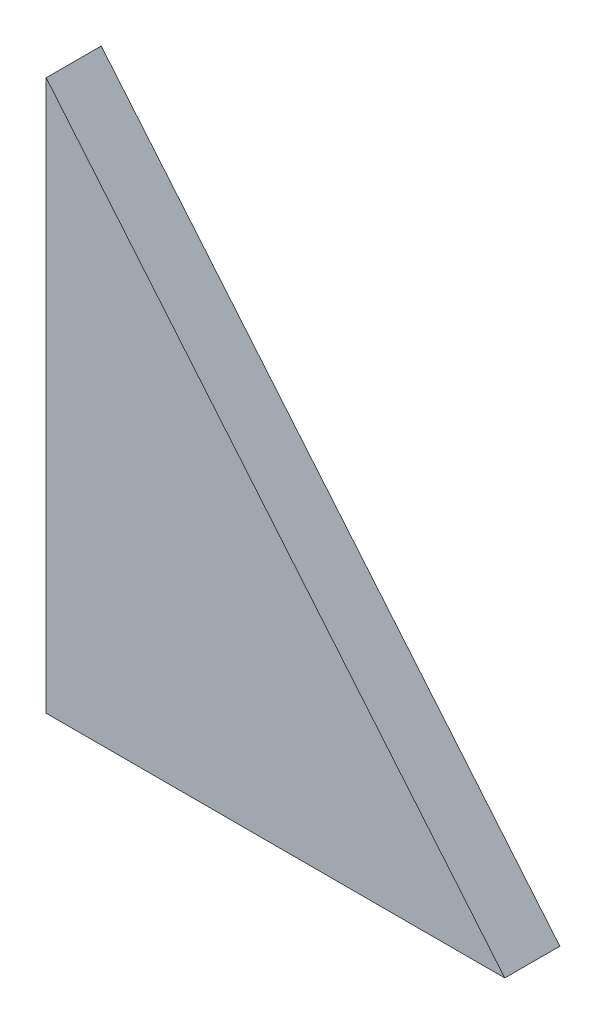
ISO-10303-21;
HEADER;
FILE_DESCRIPTION(('STEP AP214'),'2;1');
FILE_NAME('part.step','',(''),(''),'','','');
FILE_SCHEMA(('AUTOMOTIVE_DESIGN { 1 0 10303 214 1 1 1 1 }'));
ENDSEC;
DATA;
#1=APPLICATION_CONTEXT('core data for automotive mechanical design processes');
#2=APPLICATION_PROTOCOL_DEFINITION('international standard','automotive_design',2000,#1);
#3=PRODUCT_CONTEXT('',#1,'mechanical');
#4=PRODUCT('Part','Part','',(#3));
#5=PRODUCT_RELATED_PRODUCT_CATEGORY('part','',(#4));
#6=PRODUCT_DEFINITION_FORMATION('','',#4);
#7=PRODUCT_DEFINITION_CONTEXT('part definition',#1,'design');
#8=PRODUCT_DEFINITION('design','',#6,#7);
#9=PRODUCT_DEFINITION_SHAPE('','',#8);
#10=(LENGTH_UNIT() NAMED_UNIT(*) SI_UNIT(.MILLI.,.METRE.));
#11=(NAMED_UNIT(*) PLANE_ANGLE_UNIT() SI_UNIT($,.RADIAN.));
#12=(NAMED_UNIT(*) SI_UNIT($,.STERADIAN.) SOLID_ANGLE_UNIT());
#13=UNCERTAINTY_MEASURE_WITH_UNIT(LENGTH_MEASURE(1.E-05),#10,'distance_accuracy_value','');
#14=(GEOMETRIC_REPRESENTATION_CONTEXT(3) GLOBAL_UNCERTAINTY_ASSIGNED_CONTEXT((#13)) GLOBAL_UNIT_ASSIGNED_CONTEXT((#10,
#11,#12)) REPRESENTATION_CONTEXT('',''));
#15=CARTESIAN_POINT('',(0.,0.,0.));
#16=DIRECTION('',(0.,0.,1.));
#17=DIRECTION('',(1.,0.,0.));
#18=AXIS2_PLACEMENT_3D('',#15,#16,#17);
#19=CARTESIAN_POINT('',(50.,0.,6.));
#20=DIRECTION('',(-0.768221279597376,-0.64018439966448,0.));
#21=DIRECTION('',(0.64018439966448,-0.768221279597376,0.));
#22=AXIS2_PLACEMENT_3D('',#19,#20,#21);
#23=PLANE('',#22);
#24=DIRECTION('',(-0.64018439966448,0.768221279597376,0.));
#25=VECTOR('',#24,1.);
#26=CARTESIAN_POINT('',(50.,0.,0.));
#27=LINE('',#26,#25);
#28=CARTESIAN_POINT('',(50.,0.,0.));
#29=VERTEX_POINT('',#28);
#30=CARTESIAN_POINT('',(0.,60.,0.));
#31=VERTEX_POINT('',#30);
#32=EDGE_CURVE('E65',#29,#31,#27,.T.);
#33=ORIENTED_EDGE('',*,*,#32,.T.);
#34=DIRECTION('',(0.,0.,-1.));
#35=VECTOR('',#34,1.);
#36=CARTESIAN_POINT('',(0.,60.,6.));
#37=LINE('',#36,#35);
#38=CARTESIAN_POINT('',(0.,60.,6.));
#39=VERTEX_POINT('',#38);
#40=EDGE_CURVE('E11',#39,#31,#37,.T.);
#41=ORIENTED_EDGE('',*,*,#40,.F.);
#42=DIRECTION('',(-0.64018439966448,0.768221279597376,0.));
#43=VECTOR('',#42,1.);
#44=CARTESIAN_POINT('',(50.,0.,6.));
#45=LINE('',#44,#43);
#46=CARTESIAN_POINT('',(50.,0.,6.));
#47=VERTEX_POINT('',#46);
#48=EDGE_CURVE('E79',#47,#39,#45,.T.);
#49=ORIENTED_EDGE('',*,*,#48,.F.);
#50=DIRECTION('',(0.,0.,-1.));
#51=VECTOR('',#50,1.);
#52=CARTESIAN_POINT('',(50.,0.,6.));
#53=LINE('',#52,#51);
#54=EDGE_CURVE('E75',#47,#29,#53,.T.);
#55=ORIENTED_EDGE('',*,*,#54,.T.);
#56=EDGE_LOOP('',(#33,#41,#49,#55));
#57=FACE_BOUND('',#56,.T.);
#58=ADVANCED_FACE('F29',(#57),#23,.F.);
#59=CARTESIAN_POINT('',(0.,60.,6.));
#60=DIRECTION('',(1.,0.,0.));
#61=DIRECTION('',(0.,1.,0.));
#62=AXIS2_PLACEMENT_3D('',#59,#60,#61);
#63=PLANE('',#62);
#64=DIRECTION('',(0.,-1.,0.));
#65=VECTOR('',#64,1.);
#66=CARTESIAN_POINT('',(0.,60.,0.));
#67=LINE('',#66,#65);
#68=CARTESIAN_POINT('',(0.,0.,0.));
#69=VERTEX_POINT('',#68);
#70=EDGE_CURVE('E62',#31,#69,#67,.T.);
#71=ORIENTED_EDGE('',*,*,#70,.T.);
#72=DIRECTION('',(0.,0.,-1.));
#73=VECTOR('',#72,1.);
#74=CARTESIAN_POINT('',(0.,0.,6.));
#75=LINE('',#74,#73);
#76=CARTESIAN_POINT('',(0.,0.,6.));
#77=VERTEX_POINT('',#76);
#78=EDGE_CURVE('E36',#77,#69,#75,.T.);
#79=ORIENTED_EDGE('',*,*,#78,.F.);
#80=DIRECTION('',(0.,-1.,0.));
#81=VECTOR('',#80,1.);
#82=CARTESIAN_POINT('',(0.,60.,6.));
#83=LINE('',#82,#81);
#84=EDGE_CURVE('E47',#39,#77,#83,.T.);
#85=ORIENTED_EDGE('',*,*,#84,.F.);
#86=ORIENTED_EDGE('',*,*,#40,.T.);
#87=EDGE_LOOP('',(#71,#79,#85,#86));
#88=FACE_BOUND('',#87,.T.);
#89=ADVANCED_FACE('F71',(#88),#63,.F.);
#90=CARTESIAN_POINT('',(0.,0.,6.));
#91=DIRECTION('',(0.,1.,0.));
#92=DIRECTION('',(0.,0.,1.));
#93=AXIS2_PLACEMENT_3D('',#90,#91,#92);
#94=PLANE('',#93);
#95=DIRECTION('',(1.,0.,0.));
#96=VECTOR('',#95,1.);
#97=CARTESIAN_POINT('',(0.,0.,0.));
#98=LINE('',#97,#96);
#99=EDGE_CURVE('E66',#69,#29,#98,.T.);
#100=ORIENTED_EDGE('',*,*,#99,.T.);
#101=ORIENTED_EDGE('',*,*,#54,.F.);
#102=DIRECTION('',(1.,0.,0.));
#103=VECTOR('',#102,1.);
#104=CARTESIAN_POINT('',(0.,0.,6.));
#105=LINE('',#104,#103);
#106=EDGE_CURVE('E43',#77,#47,#105,.T.);
#107=ORIENTED_EDGE('',*,*,#106,.F.);
#108=ORIENTED_EDGE('',*,*,#78,.T.);
#109=EDGE_LOOP('',(#100,#101,#107,#108));
#110=FACE_BOUND('',#109,.T.);
#111=ADVANCED_FACE('F84',(#110),#94,.F.);
#112=CARTESIAN_POINT('',(50.,0.,6.));
#113=DIRECTION('',(0.,0.,-1.));
#114=DIRECTION('',(-1.,0.,0.));
#115=AXIS2_PLACEMENT_3D('',#112,#113,#114);
#116=PLANE('',#115);
#117=ORIENTED_EDGE('',*,*,#48,.T.);
#118=ORIENTED_EDGE('',*,*,#84,.T.);
#119=ORIENTED_EDGE('',*,*,#106,.T.);
#120=EDGE_LOOP('',(#117,#118,#119));
#121=FACE_BOUND('',#120,.T.);
#122=ADVANCED_FACE('F85',(#121),#116,.F.);
#123=CARTESIAN_POINT('',(50.,0.,0.));
#124=DIRECTION('',(0.,0.,-1.));
#125=DIRECTION('',(-1.,0.,0.));
#126=AXIS2_PLACEMENT_3D('',#123,#124,#125);
#127=PLANE('',#126);
#128=ORIENTED_EDGE('',*,*,#32,.F.);
#129=ORIENTED_EDGE('',*,*,#99,.F.);
#130=ORIENTED_EDGE('',*,*,#70,.F.);
#131=EDGE_LOOP('',(#128,#129,#130));
#132=FACE_BOUND('',#131,.T.);
#133=ADVANCED_FACE('F63',(#132),#127,.T.);
#134=CLOSED_SHELL('',(#58,#89,#111,#122,#133));
#135=MANIFOLD_SOLID_BREP('B2',#134);
#136=ADVANCED_BREP_SHAPE_REPRESENTATION('',(#18,#135),#14);
#137=SHAPE_DEFINITION_REPRESENTATION(#9,#136);
ENDSEC;
END-ISO-10303-21;
